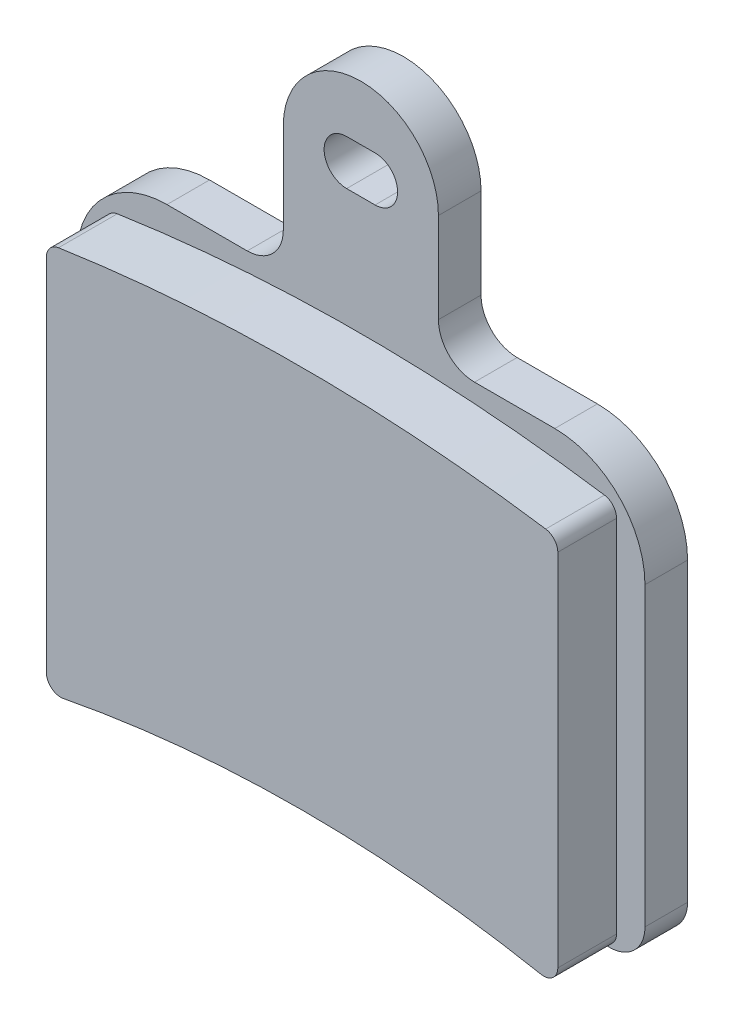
ISO-10303-21;
HEADER;
FILE_DESCRIPTION(('STEP AP214'),'2;1');
FILE_NAME('part.step','',(''),(''),'','','');
FILE_SCHEMA(('AUTOMOTIVE_DESIGN { 1 0 10303 214 1 1 1 1 }'));
ENDSEC;
DATA;
#1=APPLICATION_CONTEXT('core data for automotive mechanical design processes');
#2=APPLICATION_PROTOCOL_DEFINITION('international standard','automotive_design',2000,#1);
#3=PRODUCT_CONTEXT('',#1,'mechanical');
#4=PRODUCT('Part','Part','',(#3));
#5=PRODUCT_RELATED_PRODUCT_CATEGORY('part','',(#4));
#6=PRODUCT_DEFINITION_FORMATION('','',#4);
#7=PRODUCT_DEFINITION_CONTEXT('part definition',#1,'design');
#8=PRODUCT_DEFINITION('design','',#6,#7);
#9=PRODUCT_DEFINITION_SHAPE('','',#8);
#10=(LENGTH_UNIT() NAMED_UNIT(*) SI_UNIT(.MILLI.,.METRE.));
#11=(NAMED_UNIT(*) PLANE_ANGLE_UNIT() SI_UNIT($,.RADIAN.));
#12=(NAMED_UNIT(*) SI_UNIT($,.STERADIAN.) SOLID_ANGLE_UNIT());
#13=UNCERTAINTY_MEASURE_WITH_UNIT(LENGTH_MEASURE(1.E-05),#10,'distance_accuracy_value','');
#14=(GEOMETRIC_REPRESENTATION_CONTEXT(3) GLOBAL_UNCERTAINTY_ASSIGNED_CONTEXT((#13)) GLOBAL_UNIT_ASSIGNED_CONTEXT((#10,
#11,#12)) REPRESENTATION_CONTEXT('',''));
#15=CARTESIAN_POINT('',(0.,0.,0.));
#16=DIRECTION('',(0.,0.,1.));
#17=DIRECTION('',(1.,0.,0.));
#18=AXIS2_PLACEMENT_3D('',#15,#16,#17);
#19=CARTESIAN_POINT('',(-17.0025,-41.3461625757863,3.));
#20=DIRECTION('',(0.,0.,1.));
#21=DIRECTION('',(1.,0.,0.));
#22=AXIS2_PLACEMENT_3D('',#19,#20,#21);
#23=PLANE('',#22);
#24=CARTESIAN_POINT('',(-17.0025,-41.3461625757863,3.));
#25=DIRECTION('',(0.,0.,1.));
#26=DIRECTION('',(1.,0.,0.));
#27=AXIS2_PLACEMENT_3D('',#24,#25,#26);
#28=CIRCLE('',#27,0.999999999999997);
#29=CARTESIAN_POINT('',(-18.0025,-41.3461625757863,3.));
#30=VERTEX_POINT('',#29);
#31=CARTESIAN_POINT('',(-16.8133710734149,-42.3281148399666,3.));
#32=VERTEX_POINT('',#31);
#33=EDGE_CURVE('E124',#30,#32,#28,.T.);
#34=ORIENTED_EDGE('',*,*,#33,.F.);
#35=DIRECTION('',(0.,-1.,0.));
#36=VECTOR('',#35,1.);
#37=CARTESIAN_POINT('',(-18.0025,-41.3461625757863,3.));
#38=LINE('',#37,#36);
#39=CARTESIAN_POINT('',(-18.0025,-16.0012870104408,3.));
#40=VERTEX_POINT('',#39);
#41=EDGE_CURVE('E148',#40,#30,#38,.T.);
#42=ORIENTED_EDGE('',*,*,#41,.F.);
#43=CARTESIAN_POINT('',(-17.0025,-16.0012870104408,3.));
#44=DIRECTION('',(0.,0.,1.));
#45=DIRECTION('',(1.,0.,0.));
#46=AXIS2_PLACEMENT_3D('',#43,#44,#45);
#47=CIRCLE('',#46,0.999999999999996);
#48=CARTESIAN_POINT('',(-17.1504942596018,-15.0122987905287,3.));
#49=VERTEX_POINT('',#48);
#50=EDGE_CURVE('E145',#49,#40,#47,.T.);
#51=ORIENTED_EDGE('',*,*,#50,.F.);
#52=CARTESIAN_POINT('',(0.000190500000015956,-129.623671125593,3.));
#53=DIRECTION('',(0.,0.,1.));
#54=DIRECTION('',(1.,0.,0.));
#55=AXIS2_PLACEMENT_3D('',#52,#53,#54);
#56=CIRCLE('',#55,115.8875);
#57=CARTESIAN_POINT('',(17.1504909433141,-15.0122412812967,3.));
#58=VERTEX_POINT('',#57);
#59=EDGE_CURVE('E142',#58,#49,#56,.T.);
#60=ORIENTED_EDGE('',*,*,#59,.F.);
#61=CARTESIAN_POINT('',(17.0025,-16.0012299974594,3.));
#62=DIRECTION('',(0.,0.,1.));
#63=DIRECTION('',(-1.,0.,0.));
#64=AXIS2_PLACEMENT_3D('',#61,#62,#63);
#65=CIRCLE('',#64,1.);
#66=CARTESIAN_POINT('',(18.0025,-16.0012299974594,3.));
#67=VERTEX_POINT('',#66);
#68=EDGE_CURVE('E139',#67,#58,#65,.T.);
#69=ORIENTED_EDGE('',*,*,#68,.F.);
#70=DIRECTION('',(0.,1.,0.));
#71=VECTOR('',#70,1.);
#72=CARTESIAN_POINT('',(18.0025,-16.0012299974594,3.));
#73=LINE('',#72,#71);
#74=CARTESIAN_POINT('',(18.0025,-41.3460891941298,3.));
#75=VERTEX_POINT('',#74);
#76=EDGE_CURVE('E136',#75,#67,#73,.T.);
#77=ORIENTED_EDGE('',*,*,#76,.F.);
#78=CARTESIAN_POINT('',(17.0025,-41.3460891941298,3.));
#79=DIRECTION('',(0.,0.,1.));
#80=DIRECTION('',(-1.,0.,0.));
#81=AXIS2_PLACEMENT_3D('',#78,#79,#80);
#82=CIRCLE('',#81,1.00000000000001);
#83=CARTESIAN_POINT('',(16.8133753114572,-42.3280422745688,3.));
#84=VERTEX_POINT('',#83);
#85=EDGE_CURVE('E127',#84,#75,#82,.T.);
#86=ORIENTED_EDGE('',*,*,#85,.F.);
#87=CARTESIAN_POINT('',(0.000190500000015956,-129.623671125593,3.));
#88=DIRECTION('',(0.,0.,-1.));
#89=DIRECTION('',(1.,0.,0.));
#90=AXIS2_PLACEMENT_3D('',#87,#88,#89);
#91=CIRCLE('',#90,88.9);
#92=EDGE_CURVE('E116',#32,#84,#91,.T.);
#93=ORIENTED_EDGE('',*,*,#92,.F.);
#94=EDGE_LOOP('',(#34,#42,#51,#60,#69,#77,#86,#93));
#95=FACE_BOUND('',#94,.T.);
#96=ADVANCED_FACE('F45',(#95),#23,.F.);
#97=CARTESIAN_POINT('',(-18.0025,-41.3461625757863,54.6237309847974));
#98=DIRECTION('',(1.,0.,0.));
#99=DIRECTION('',(0.,0.,-1.));
#100=AXIS2_PLACEMENT_3D('',#97,#98,#99);
#101=PLANE('',#100);
#102=DIRECTION('',(0.,0.,-1.));
#103=VECTOR('',#102,1.);
#104=CARTESIAN_POINT('',(-18.0025,-41.3461625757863,54.6237309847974));
#105=LINE('',#104,#103);
#106=CARTESIAN_POINT('',(-18.0025,-41.3461625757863,7.13577999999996));
#107=VERTEX_POINT('',#106);
#108=EDGE_CURVE('E130',#107,#30,#105,.T.);
#109=ORIENTED_EDGE('',*,*,#108,.F.);
#110=DIRECTION('',(0.,1.,0.));
#111=VECTOR('',#110,1.);
#112=CARTESIAN_POINT('',(-18.0025,-41.3461625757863,7.13577999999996));
#113=LINE('',#112,#111);
#114=CARTESIAN_POINT('',(-18.0025,-16.0012870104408,7.13577999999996));
#115=VERTEX_POINT('',#114);
#116=EDGE_CURVE('E49',#107,#115,#113,.T.);
#117=ORIENTED_EDGE('',*,*,#116,.T.);
#118=DIRECTION('',(0.,0.,-1.));
#119=VECTOR('',#118,1.);
#120=CARTESIAN_POINT('',(-18.0025,-16.0012870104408,54.6237309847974));
#121=LINE('',#120,#119);
#122=EDGE_CURVE('E151',#115,#40,#121,.T.);
#123=ORIENTED_EDGE('',*,*,#122,.T.);
#124=ORIENTED_EDGE('',*,*,#41,.T.);
#125=EDGE_LOOP('',(#109,#117,#123,#124));
#126=FACE_BOUND('',#125,.T.);
#127=ADVANCED_FACE('F178',(#126),#101,.F.);
#128=CARTESIAN_POINT('',(-17.0025,-16.0012870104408,54.6237309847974));
#129=DIRECTION('',(0.,0.,-1.));
#130=DIRECTION('',(-1.,0.,0.));
#131=AXIS2_PLACEMENT_3D('',#128,#129,#130);
#132=CYLINDRICAL_SURFACE('',#131,0.999999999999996);
#133=ORIENTED_EDGE('',*,*,#122,.F.);
#134=CARTESIAN_POINT('',(-17.0025,-16.0012870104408,7.13577999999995));
#135=DIRECTION('',(0.,0.,-1.));
#136=DIRECTION('',(-1.,0.,0.));
#137=AXIS2_PLACEMENT_3D('',#134,#135,#136);
#138=CIRCLE('',#137,0.999999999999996);
#139=CARTESIAN_POINT('',(-17.1504942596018,-15.0122987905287,7.13577999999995));
#140=VERTEX_POINT('',#139);
#141=EDGE_CURVE('E172',#115,#140,#138,.T.);
#142=ORIENTED_EDGE('',*,*,#141,.T.);
#143=DIRECTION('',(0.,0.,-1.));
#144=VECTOR('',#143,1.);
#145=CARTESIAN_POINT('',(-17.1504942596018,-15.0122987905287,54.6237309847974));
#146=LINE('',#145,#144);
#147=EDGE_CURVE('E153',#140,#49,#146,.T.);
#148=ORIENTED_EDGE('',*,*,#147,.T.);
#149=ORIENTED_EDGE('',*,*,#50,.T.);
#150=EDGE_LOOP('',(#133,#142,#148,#149));
#151=FACE_BOUND('',#150,.T.);
#152=ADVANCED_FACE('F180',(#151),#132,.T.);
#153=CARTESIAN_POINT('',(0.000190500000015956,-129.623671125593,54.6237309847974));
#154=DIRECTION('',(0.,0.,-1.));
#155=DIRECTION('',(-1.,0.,0.));
#156=AXIS2_PLACEMENT_3D('',#153,#154,#155);
#157=CYLINDRICAL_SURFACE('',#156,115.8875);
#158=ORIENTED_EDGE('',*,*,#147,.F.);
#159=CARTESIAN_POINT('',(0.000190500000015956,-129.623671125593,7.13577999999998));
#160=DIRECTION('',(0.,0.,-1.));
#161=DIRECTION('',(-1.,0.,0.));
#162=AXIS2_PLACEMENT_3D('',#159,#160,#161);
#163=CIRCLE('',#162,115.8875);
#164=CARTESIAN_POINT('',(17.1504909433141,-15.0122412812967,7.13577999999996));
#165=VERTEX_POINT('',#164);
#166=EDGE_CURVE('E64',#140,#165,#163,.T.);
#167=ORIENTED_EDGE('',*,*,#166,.T.);
#168=DIRECTION('',(0.,0.,-1.));
#169=VECTOR('',#168,1.);
#170=CARTESIAN_POINT('',(17.1504909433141,-15.0122412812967,54.6237309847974));
#171=LINE('',#170,#169);
#172=EDGE_CURVE('E155',#165,#58,#171,.T.);
#173=ORIENTED_EDGE('',*,*,#172,.T.);
#174=ORIENTED_EDGE('',*,*,#59,.T.);
#175=EDGE_LOOP('',(#158,#167,#173,#174));
#176=FACE_BOUND('',#175,.T.);
#177=ADVANCED_FACE('F185',(#176),#157,.T.);
#178=CARTESIAN_POINT('',(17.0025,-16.0012299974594,54.6237309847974));
#179=DIRECTION('',(0.,0.,-1.));
#180=DIRECTION('',(-1.,0.,0.));
#181=AXIS2_PLACEMENT_3D('',#178,#179,#180);
#182=CYLINDRICAL_SURFACE('',#181,1.);
#183=ORIENTED_EDGE('',*,*,#172,.F.);
#184=CARTESIAN_POINT('',(17.0025,-16.0012299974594,7.13577999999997));
#185=DIRECTION('',(0.,0.,-1.));
#186=DIRECTION('',(-1.,0.,0.));
#187=AXIS2_PLACEMENT_3D('',#184,#185,#186);
#188=CIRCLE('',#187,1.);
#189=CARTESIAN_POINT('',(18.0025,-16.0012299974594,7.13577999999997));
#190=VERTEX_POINT('',#189);
#191=EDGE_CURVE('E166',#165,#190,#188,.T.);
#192=ORIENTED_EDGE('',*,*,#191,.T.);
#193=DIRECTION('',(0.,0.,-1.));
#194=VECTOR('',#193,1.);
#195=CARTESIAN_POINT('',(18.0025,-16.0012299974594,54.6237309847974));
#196=LINE('',#195,#194);
#197=EDGE_CURVE('E157',#190,#67,#196,.T.);
#198=ORIENTED_EDGE('',*,*,#197,.T.);
#199=ORIENTED_EDGE('',*,*,#68,.T.);
#200=EDGE_LOOP('',(#183,#192,#198,#199));
#201=FACE_BOUND('',#200,.T.);
#202=ADVANCED_FACE('F188',(#201),#182,.T.);
#203=CARTESIAN_POINT('',(18.0025,-16.0012299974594,54.6237309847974));
#204=DIRECTION('',(-1.,0.,0.));
#205=DIRECTION('',(0.,-1.,0.));
#206=AXIS2_PLACEMENT_3D('',#203,#204,#205);
#207=PLANE('',#206);
#208=ORIENTED_EDGE('',*,*,#197,.F.);
#209=DIRECTION('',(0.,-1.,0.));
#210=VECTOR('',#209,1.);
#211=CARTESIAN_POINT('',(18.0025,-16.0012299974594,7.13577999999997));
#212=LINE('',#211,#210);
#213=CARTESIAN_POINT('',(18.0025,-41.3460891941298,7.13577999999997));
#214=VERTEX_POINT('',#213);
#215=EDGE_CURVE('E164',#190,#214,#212,.T.);
#216=ORIENTED_EDGE('',*,*,#215,.T.);
#217=DIRECTION('',(0.,0.,-1.));
#218=VECTOR('',#217,1.);
#219=CARTESIAN_POINT('',(18.0025,-41.3460891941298,54.6237309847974));
#220=LINE('',#219,#218);
#221=EDGE_CURVE('E159',#214,#75,#220,.T.);
#222=ORIENTED_EDGE('',*,*,#221,.T.);
#223=ORIENTED_EDGE('',*,*,#76,.T.);
#224=EDGE_LOOP('',(#208,#216,#222,#223));
#225=FACE_BOUND('',#224,.T.);
#226=ADVANCED_FACE('F191',(#225),#207,.F.);
#227=CARTESIAN_POINT('',(17.0025,-41.3460891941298,54.6237309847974));
#228=DIRECTION('',(0.,0.,-1.));
#229=DIRECTION('',(-1.,0.,0.));
#230=AXIS2_PLACEMENT_3D('',#227,#228,#229);
#231=CYLINDRICAL_SURFACE('',#230,1.00000000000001);
#232=ORIENTED_EDGE('',*,*,#221,.F.);
#233=CARTESIAN_POINT('',(17.0025,-41.3460891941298,7.13577999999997));
#234=DIRECTION('',(0.,0.,-1.));
#235=DIRECTION('',(-1.,0.,0.));
#236=AXIS2_PLACEMENT_3D('',#233,#234,#235);
#237=CIRCLE('',#236,1.00000000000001);
#238=CARTESIAN_POINT('',(16.8133753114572,-42.3280422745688,7.13577999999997));
#239=VERTEX_POINT('',#238);
#240=EDGE_CURVE('E77',#214,#239,#237,.T.);
#241=ORIENTED_EDGE('',*,*,#240,.T.);
#242=DIRECTION('',(0.,0.,-1.));
#243=VECTOR('',#242,1.);
#244=CARTESIAN_POINT('',(16.8133753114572,-42.3280422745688,54.6237309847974));
#245=LINE('',#244,#243);
#246=EDGE_CURVE('E120',#239,#84,#245,.T.);
#247=ORIENTED_EDGE('',*,*,#246,.T.);
#248=ORIENTED_EDGE('',*,*,#85,.T.);
#249=EDGE_LOOP('',(#232,#241,#247,#248));
#250=FACE_BOUND('',#249,.T.);
#251=ADVANCED_FACE('F162',(#250),#231,.T.);
#252=CARTESIAN_POINT('',(0.000190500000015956,-129.623671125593,54.6237309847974));
#253=DIRECTION('',(0.,0.,-1.));
#254=DIRECTION('',(-1.,0.,0.));
#255=AXIS2_PLACEMENT_3D('',#252,#253,#254);
#256=CYLINDRICAL_SURFACE('',#255,88.9);
#257=ORIENTED_EDGE('',*,*,#246,.F.);
#258=CARTESIAN_POINT('',(0.000190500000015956,-129.623671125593,7.13577999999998));
#259=DIRECTION('',(0.,0.,-1.));
#260=DIRECTION('',(-1.,0.,0.));
#261=AXIS2_PLACEMENT_3D('',#258,#259,#260);
#262=CIRCLE('',#261,88.9);
#263=CARTESIAN_POINT('',(-16.8133710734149,-42.3281148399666,7.13577999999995));
#264=VERTEX_POINT('',#263);
#265=EDGE_CURVE('E55',#239,#264,#262,.F.);
#266=ORIENTED_EDGE('',*,*,#265,.T.);
#267=DIRECTION('',(0.,0.,-1.));
#268=VECTOR('',#267,1.);
#269=CARTESIAN_POINT('',(-16.8133710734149,-42.3281148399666,54.6237309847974));
#270=LINE('',#269,#268);
#271=EDGE_CURVE('E113',#264,#32,#270,.T.);
#272=ORIENTED_EDGE('',*,*,#271,.T.);
#273=ORIENTED_EDGE('',*,*,#92,.T.);
#274=EDGE_LOOP('',(#257,#266,#272,#273));
#275=FACE_BOUND('',#274,.T.);
#276=ADVANCED_FACE('F115',(#275),#256,.F.);
#277=CARTESIAN_POINT('',(-17.0025,-41.3461625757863,54.6237309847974));
#278=DIRECTION('',(0.,0.,-1.));
#279=DIRECTION('',(-1.,0.,0.));
#280=AXIS2_PLACEMENT_3D('',#277,#278,#279);
#281=CYLINDRICAL_SURFACE('',#280,0.999999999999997);
#282=ORIENTED_EDGE('',*,*,#271,.F.);
#283=CARTESIAN_POINT('',(-17.0025,-41.3461625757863,7.13577999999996));
#284=DIRECTION('',(0.,0.,-1.));
#285=DIRECTION('',(-1.,0.,0.));
#286=AXIS2_PLACEMENT_3D('',#283,#284,#285);
#287=CIRCLE('',#286,0.999999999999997);
#288=EDGE_CURVE('E13',#264,#107,#287,.T.);
#289=ORIENTED_EDGE('',*,*,#288,.T.);
#290=ORIENTED_EDGE('',*,*,#108,.T.);
#291=ORIENTED_EDGE('',*,*,#33,.T.);
#292=EDGE_LOOP('',(#282,#289,#290,#291));
#293=FACE_BOUND('',#292,.T.);
#294=ADVANCED_FACE('F47',(#293),#281,.T.);
#295=CARTESIAN_POINT('',(-88.2588661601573,109.715518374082,7.13577999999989));
#296=DIRECTION('',(0.,0.,-1.));
#297=DIRECTION('',(0.938239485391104,0.345986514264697,0.));
#298=AXIS2_PLACEMENT_3D('',#295,#296,#297);
#299=PLANE('',#298);
#300=ORIENTED_EDGE('',*,*,#265,.F.);
#301=ORIENTED_EDGE('',*,*,#240,.F.);
#302=ORIENTED_EDGE('',*,*,#215,.F.);
#303=ORIENTED_EDGE('',*,*,#191,.F.);
#304=ORIENTED_EDGE('',*,*,#166,.F.);
#305=ORIENTED_EDGE('',*,*,#141,.F.);
#306=ORIENTED_EDGE('',*,*,#116,.F.);
#307=ORIENTED_EDGE('',*,*,#288,.F.);
#308=EDGE_LOOP('',(#300,#301,#302,#303,#304,#305,#306,#307));
#309=FACE_BOUND('',#308,.T.);
#310=ADVANCED_FACE('F179',(#309),#299,.F.);
#311=CLOSED_SHELL('',(#96,#127,#152,#177,#202,#226,#251,#276,#294,#310));
#312=MANIFOLD_SOLID_BREP('B2',#311);
#313=CARTESIAN_POINT('',(0.,-3.81,3.));
#314=DIRECTION('',(0.,0.,-1.));
#315=DIRECTION('',(-1.,0.,0.));
#316=AXIS2_PLACEMENT_3D('',#313,#314,#315);
#317=CYLINDRICAL_SURFACE('',#316,5.461);
#318=CARTESIAN_POINT('',(0.,-3.81,0.));
#319=DIRECTION('',(0.,0.,1.));
#320=DIRECTION('',(-1.,0.,0.));
#321=AXIS2_PLACEMENT_3D('',#318,#319,#320);
#322=CIRCLE('',#321,5.461);
#323=CARTESIAN_POINT('',(5.461,-3.81,0.));
#324=VERTEX_POINT('',#323);
#325=CARTESIAN_POINT('',(-5.461,-3.81,0.));
#326=VERTEX_POINT('',#325);
#327=EDGE_CURVE('E429',#324,#326,#322,.T.);
#328=ORIENTED_EDGE('',*,*,#327,.T.);
#329=DIRECTION('',(0.,0.,-1.));
#330=VECTOR('',#329,1.);
#331=CARTESIAN_POINT('',(-5.461,-3.81,3.));
#332=LINE('',#331,#330);
#333=CARTESIAN_POINT('',(-5.461,-3.81,3.));
#334=VERTEX_POINT('',#333);
#335=EDGE_CURVE('E43',#334,#326,#332,.T.);
#336=ORIENTED_EDGE('',*,*,#335,.F.);
#337=CARTESIAN_POINT('',(0.,-3.81,3.));
#338=DIRECTION('',(0.,0.,1.));
#339=DIRECTION('',(-1.,0.,0.));
#340=AXIS2_PLACEMENT_3D('',#337,#338,#339);
#341=CIRCLE('',#340,5.461);
#342=CARTESIAN_POINT('',(5.461,-3.81,3.));
#343=VERTEX_POINT('',#342);
#344=EDGE_CURVE('E433',#343,#334,#341,.T.);
#345=ORIENTED_EDGE('',*,*,#344,.F.);
#346=DIRECTION('',(0.,0.,-1.));
#347=VECTOR('',#346,1.);
#348=CARTESIAN_POINT('',(5.461,-3.81,3.));
#349=LINE('',#348,#347);
#350=EDGE_CURVE('E463',#343,#324,#349,.T.);
#351=ORIENTED_EDGE('',*,*,#350,.T.);
#352=EDGE_LOOP('',(#328,#336,#345,#351));
#353=FACE_BOUND('',#352,.T.);
#354=ADVANCED_FACE('F272',(#353),#317,.T.);
#355=CARTESIAN_POINT('',(-5.461,-3.81,3.));
#356=DIRECTION('',(1.,0.,0.));
#357=DIRECTION('',(0.,1.,0.));
#358=AXIS2_PLACEMENT_3D('',#355,#356,#357);
#359=PLANE('',#358);
#360=DIRECTION('',(0.,-1.,0.));
#361=VECTOR('',#360,1.);
#362=CARTESIAN_POINT('',(-5.461,-3.81,0.));
#363=LINE('',#362,#361);
#364=CARTESIAN_POINT('',(-5.461,-10.16,0.));
#365=VERTEX_POINT('',#364);
#366=EDGE_CURVE('E466',#326,#365,#363,.T.);
#367=ORIENTED_EDGE('',*,*,#366,.T.);
#368=DIRECTION('',(0.,0.,-1.));
#369=VECTOR('',#368,1.);
#370=CARTESIAN_POINT('',(-5.461,-10.16,3.));
#371=LINE('',#370,#369);
#372=CARTESIAN_POINT('',(-5.461,-10.16,3.));
#373=VERTEX_POINT('',#372);
#374=EDGE_CURVE('E279',#373,#365,#371,.T.);
#375=ORIENTED_EDGE('',*,*,#374,.F.);
#376=DIRECTION('',(0.,-1.,0.));
#377=VECTOR('',#376,1.);
#378=CARTESIAN_POINT('',(-5.461,-3.81,3.));
#379=LINE('',#378,#377);
#380=EDGE_CURVE('E436',#334,#373,#379,.T.);
#381=ORIENTED_EDGE('',*,*,#380,.F.);
#382=ORIENTED_EDGE('',*,*,#335,.T.);
#383=EDGE_LOOP('',(#367,#375,#381,#382));
#384=FACE_BOUND('',#383,.T.);
#385=ADVANCED_FACE('F551',(#384),#359,.F.);
#386=CARTESIAN_POINT('',(-8.001,-10.16,3.));
#387=DIRECTION('',(0.,0.,-1.));
#388=DIRECTION('',(-1.,0.,0.));
#389=AXIS2_PLACEMENT_3D('',#386,#387,#388);
#390=CYLINDRICAL_SURFACE('',#389,2.54);
#391=CARTESIAN_POINT('',(-8.001,-10.16,0.));
#392=DIRECTION('',(0.,0.,-1.));
#393=DIRECTION('',(1.,0.,0.));
#394=AXIS2_PLACEMENT_3D('',#391,#392,#393);
#395=CIRCLE('',#394,2.54);
#396=CARTESIAN_POINT('',(-8.001,-12.7,0.));
#397=VERTEX_POINT('',#396);
#398=EDGE_CURVE('E468',#365,#397,#395,.T.);
#399=ORIENTED_EDGE('',*,*,#398,.T.);
#400=DIRECTION('',(0.,0.,-1.));
#401=VECTOR('',#400,1.);
#402=CARTESIAN_POINT('',(-8.001,-12.7,3.));
#403=LINE('',#402,#401);
#404=CARTESIAN_POINT('',(-8.001,-12.7,3.));
#405=VERTEX_POINT('',#404);
#406=EDGE_CURVE('E523',#405,#397,#403,.T.);
#407=ORIENTED_EDGE('',*,*,#406,.F.);
#408=CARTESIAN_POINT('',(-8.001,-10.16,3.));
#409=DIRECTION('',(0.,0.,-1.));
#410=DIRECTION('',(1.,0.,0.));
#411=AXIS2_PLACEMENT_3D('',#408,#409,#410);
#412=CIRCLE('',#411,2.54);
#413=EDGE_CURVE('E439',#373,#405,#412,.T.);
#414=ORIENTED_EDGE('',*,*,#413,.F.);
#415=ORIENTED_EDGE('',*,*,#374,.T.);
#416=EDGE_LOOP('',(#399,#407,#414,#415));
#417=FACE_BOUND('',#416,.T.);
#418=ADVANCED_FACE('F530',(#417),#390,.F.);
#419=CARTESIAN_POINT('',(-8.001,-12.7,3.));
#420=DIRECTION('',(0.,-1.,0.));
#421=DIRECTION('',(0.,0.,-1.));
#422=AXIS2_PLACEMENT_3D('',#419,#420,#421);
#423=PLANE('',#422);
#424=DIRECTION('',(-1.,0.,0.));
#425=VECTOR('',#424,1.);
#426=CARTESIAN_POINT('',(-8.001,-12.7,0.));
#427=LINE('',#426,#425);
#428=CARTESIAN_POINT('',(-13.6525,-12.7,0.));
#429=VERTEX_POINT('',#428);
#430=EDGE_CURVE('E470',#397,#429,#427,.T.);
#431=ORIENTED_EDGE('',*,*,#430,.T.);
#432=DIRECTION('',(0.,0.,-1.));
#433=VECTOR('',#432,1.);
#434=CARTESIAN_POINT('',(-13.6525,-12.7,3.));
#435=LINE('',#434,#433);
#436=CARTESIAN_POINT('',(-13.6525,-12.7,3.));
#437=VERTEX_POINT('',#436);
#438=EDGE_CURVE('E520',#437,#429,#435,.T.);
#439=ORIENTED_EDGE('',*,*,#438,.F.);
#440=DIRECTION('',(-1.,0.,0.));
#441=VECTOR('',#440,1.);
#442=CARTESIAN_POINT('',(-8.001,-12.7,3.));
#443=LINE('',#442,#441);
#444=EDGE_CURVE('E441',#405,#437,#443,.T.);
#445=ORIENTED_EDGE('',*,*,#444,.F.);
#446=ORIENTED_EDGE('',*,*,#406,.T.);
#447=EDGE_LOOP('',(#431,#439,#445,#446));
#448=FACE_BOUND('',#447,.T.);
#449=ADVANCED_FACE('F539',(#448),#423,.F.);
#450=CARTESIAN_POINT('',(-13.6525,-19.05,3.));
#451=DIRECTION('',(0.,0.,-1.));
#452=DIRECTION('',(-1.,0.,0.));
#453=AXIS2_PLACEMENT_3D('',#450,#451,#452);
#454=CYLINDRICAL_SURFACE('',#453,6.35);
#455=CARTESIAN_POINT('',(-13.6525,-19.05,0.));
#456=DIRECTION('',(0.,0.,1.));
#457=DIRECTION('',(1.,0.,0.));
#458=AXIS2_PLACEMENT_3D('',#455,#456,#457);
#459=CIRCLE('',#458,6.35);
#460=CARTESIAN_POINT('',(-20.0025,-19.05,0.));
#461=VERTEX_POINT('',#460);
#462=EDGE_CURVE('E472',#429,#461,#459,.T.);
#463=ORIENTED_EDGE('',*,*,#462,.T.);
#464=DIRECTION('',(0.,0.,-1.));
#465=VECTOR('',#464,1.);
#466=CARTESIAN_POINT('',(-20.0025,-19.05,3.));
#467=LINE('',#466,#465);
#468=CARTESIAN_POINT('',(-20.0025,-19.05,3.));
#469=VERTEX_POINT('',#468);
#470=EDGE_CURVE('E517',#469,#461,#467,.T.);
#471=ORIENTED_EDGE('',*,*,#470,.F.);
#472=CARTESIAN_POINT('',(-13.6525,-19.05,3.));
#473=DIRECTION('',(0.,0.,1.));
#474=DIRECTION('',(1.,0.,0.));
#475=AXIS2_PLACEMENT_3D('',#472,#473,#474);
#476=CIRCLE('',#475,6.35);
#477=EDGE_CURVE('E443',#437,#469,#476,.T.);
#478=ORIENTED_EDGE('',*,*,#477,.F.);
#479=ORIENTED_EDGE('',*,*,#438,.T.);
#480=EDGE_LOOP('',(#463,#471,#478,#479));
#481=FACE_BOUND('',#480,.T.);
#482=ADVANCED_FACE('F543',(#481),#454,.T.);
#483=CARTESIAN_POINT('',(-20.0025,-19.05,3.));
#484=DIRECTION('',(1.,0.,0.));
#485=DIRECTION('',(0.,0.,-1.));
#486=AXIS2_PLACEMENT_3D('',#483,#484,#485);
#487=PLANE('',#486);
#488=DIRECTION('',(0.,-1.,0.));
#489=VECTOR('',#488,1.);
#490=CARTESIAN_POINT('',(-20.0025,-19.05,0.));
#491=LINE('',#490,#489);
#492=CARTESIAN_POINT('',(-20.0025,-39.9151663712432,0.));
#493=VERTEX_POINT('',#492);
#494=EDGE_CURVE('E474',#461,#493,#491,.T.);
#495=ORIENTED_EDGE('',*,*,#494,.T.);
#496=DIRECTION('',(0.,0.,-1.));
#497=VECTOR('',#496,1.);
#498=CARTESIAN_POINT('',(-20.0025,-39.9151663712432,3.));
#499=LINE('',#498,#497);
#500=CARTESIAN_POINT('',(-20.0025,-39.9151663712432,3.));
#501=VERTEX_POINT('',#500);
#502=EDGE_CURVE('E514',#501,#493,#499,.T.);
#503=ORIENTED_EDGE('',*,*,#502,.F.);
#504=DIRECTION('',(0.,-1.,0.));
#505=VECTOR('',#504,1.);
#506=CARTESIAN_POINT('',(-20.0025,-19.05,3.));
#507=LINE('',#506,#505);
#508=EDGE_CURVE('E445',#469,#501,#507,.T.);
#509=ORIENTED_EDGE('',*,*,#508,.F.);
#510=ORIENTED_EDGE('',*,*,#470,.T.);
#511=EDGE_LOOP('',(#495,#503,#509,#510));
#512=FACE_BOUND('',#511,.T.);
#513=ADVANCED_FACE('F594',(#512),#487,.F.);
#514=CARTESIAN_POINT('',(-17.5025,-39.9151663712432,3.));
#515=DIRECTION('',(0.,0.,-1.));
#516=DIRECTION('',(-1.,0.,0.));
#517=AXIS2_PLACEMENT_3D('',#514,#515,#516);
#518=CYLINDRICAL_SURFACE('',#517,2.50000000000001);
#519=CARTESIAN_POINT('',(-17.5025,-39.9151663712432,0.));
#520=DIRECTION('',(0.,0.,1.));
#521=DIRECTION('',(1.,0.,0.));
#522=AXIS2_PLACEMENT_3D('',#519,#520,#521);
#523=CIRCLE('',#522,2.50000000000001);
#524=CARTESIAN_POINT('',(-17.0237612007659,-42.3689000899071,0.));
#525=VERTEX_POINT('',#524);
#526=EDGE_CURVE('E476',#493,#525,#523,.T.);
#527=ORIENTED_EDGE('',*,*,#526,.T.);
#528=DIRECTION('',(0.,0.,-1.));
#529=VECTOR('',#528,1.);
#530=CARTESIAN_POINT('',(-17.0237612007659,-42.3689000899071,3.));
#531=LINE('',#530,#529);
#532=CARTESIAN_POINT('',(-17.0237612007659,-42.3689000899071,3.));
#533=VERTEX_POINT('',#532);
#534=EDGE_CURVE('E511',#533,#525,#531,.T.);
#535=ORIENTED_EDGE('',*,*,#534,.F.);
#536=CARTESIAN_POINT('',(-17.5025,-39.9151663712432,3.));
#537=DIRECTION('',(0.,0.,1.));
#538=DIRECTION('',(1.,0.,0.));
#539=AXIS2_PLACEMENT_3D('',#536,#537,#538);
#540=CIRCLE('',#539,2.50000000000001);
#541=EDGE_CURVE('E447',#501,#533,#540,.T.);
#542=ORIENTED_EDGE('',*,*,#541,.F.);
#543=ORIENTED_EDGE('',*,*,#502,.T.);
#544=EDGE_LOOP('',(#527,#535,#542,#543));
#545=FACE_BOUND('',#544,.T.);
#546=ADVANCED_FACE('F592',(#545),#518,.T.);
#547=CARTESIAN_POINT('',(0.000190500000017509,-129.623671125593,3.));
#548=DIRECTION('',(0.,0.,-1.));
#549=DIRECTION('',(-1.,0.,0.));
#550=AXIS2_PLACEMENT_3D('',#547,#548,#549);
#551=CYLINDRICAL_SURFACE('',#550,88.9);
#552=CARTESIAN_POINT('',(0.000190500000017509,-129.623671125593,0.));
#553=DIRECTION('',(0.,0.,-1.));
#554=DIRECTION('',(1.,0.,0.));
#555=AXIS2_PLACEMENT_3D('',#552,#553,#554);
#556=CIRCLE('',#555,88.9);
#557=CARTESIAN_POINT('',(17.0237716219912,-42.3688277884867,0.));
#558=VERTEX_POINT('',#557);
#559=EDGE_CURVE('E478',#525,#558,#556,.T.);
#560=ORIENTED_EDGE('',*,*,#559,.T.);
#561=DIRECTION('',(0.,0.,-1.));
#562=VECTOR('',#561,1.);
#563=CARTESIAN_POINT('',(17.0237716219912,-42.3688277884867,3.));
#564=LINE('',#563,#562);
#565=CARTESIAN_POINT('',(17.0237716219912,-42.3688277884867,3.));
#566=VERTEX_POINT('',#565);
#567=EDGE_CURVE('E508',#566,#558,#564,.T.);
#568=ORIENTED_EDGE('',*,*,#567,.F.);
#569=CARTESIAN_POINT('',(0.000190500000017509,-129.623671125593,3.));
#570=DIRECTION('',(0.,0.,-1.));
#571=DIRECTION('',(1.,0.,0.));
#572=AXIS2_PLACEMENT_3D('',#569,#570,#571);
#573=CIRCLE('',#572,88.9);
#574=EDGE_CURVE('E449',#533,#566,#573,.T.);
#575=ORIENTED_EDGE('',*,*,#574,.F.);
#576=ORIENTED_EDGE('',*,*,#534,.T.);
#577=EDGE_LOOP('',(#560,#568,#575,#576));
#578=FACE_BOUND('',#577,.T.);
#579=ADVANCED_FACE('F587',(#578),#551,.F.);
#580=CARTESIAN_POINT('',(17.5025,-39.9150920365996,3.));
#581=DIRECTION('',(0.,0.,-1.));
#582=DIRECTION('',(-1.,0.,0.));
#583=AXIS2_PLACEMENT_3D('',#580,#581,#582);
#584=CYLINDRICAL_SURFACE('',#583,2.5);
#585=CARTESIAN_POINT('',(17.5025,-39.9150920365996,0.));
#586=DIRECTION('',(0.,0.,1.));
#587=DIRECTION('',(-1.,0.,0.));
#588=AXIS2_PLACEMENT_3D('',#585,#586,#587);
#589=CIRCLE('',#588,2.5);
#590=CARTESIAN_POINT('',(20.0025,-39.9150920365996,0.));
#591=VERTEX_POINT('',#590);
#592=EDGE_CURVE('E480',#558,#591,#589,.T.);
#593=ORIENTED_EDGE('',*,*,#592,.T.);
#594=DIRECTION('',(0.,0.,-1.));
#595=VECTOR('',#594,1.);
#596=CARTESIAN_POINT('',(20.0025,-39.9150920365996,3.));
#597=LINE('',#596,#595);
#598=CARTESIAN_POINT('',(20.0025,-39.9150920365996,3.));
#599=VERTEX_POINT('',#598);
#600=EDGE_CURVE('E505',#599,#591,#597,.T.);
#601=ORIENTED_EDGE('',*,*,#600,.F.);
#602=CARTESIAN_POINT('',(17.5025,-39.9150920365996,3.));
#603=DIRECTION('',(0.,0.,1.));
#604=DIRECTION('',(-1.,0.,0.));
#605=AXIS2_PLACEMENT_3D('',#602,#603,#604);
#606=CIRCLE('',#605,2.5);
#607=EDGE_CURVE('E451',#566,#599,#606,.T.);
#608=ORIENTED_EDGE('',*,*,#607,.F.);
#609=ORIENTED_EDGE('',*,*,#567,.T.);
#610=EDGE_LOOP('',(#593,#601,#608,#609));
#611=FACE_BOUND('',#610,.T.);
#612=ADVANCED_FACE('F582',(#611),#584,.T.);
#613=CARTESIAN_POINT('',(20.0025,-39.9150920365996,3.));
#614=DIRECTION('',(-1.,0.,0.));
#615=DIRECTION('',(0.,-1.,0.));
#616=AXIS2_PLACEMENT_3D('',#613,#614,#615);
#617=PLANE('',#616);
#618=DIRECTION('',(0.,1.,0.));
#619=VECTOR('',#618,1.);
#620=CARTESIAN_POINT('',(20.0025,-39.9150920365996,0.));
#621=LINE('',#620,#619);
#622=CARTESIAN_POINT('',(20.0025,-19.05,0.));
#623=VERTEX_POINT('',#622);
#624=EDGE_CURVE('E482',#591,#623,#621,.T.);
#625=ORIENTED_EDGE('',*,*,#624,.T.);
#626=DIRECTION('',(0.,0.,-1.));
#627=VECTOR('',#626,1.);
#628=CARTESIAN_POINT('',(20.0025,-19.05,3.));
#629=LINE('',#628,#627);
#630=CARTESIAN_POINT('',(20.0025,-19.05,3.));
#631=VERTEX_POINT('',#630);
#632=EDGE_CURVE('E502',#631,#623,#629,.T.);
#633=ORIENTED_EDGE('',*,*,#632,.F.);
#634=DIRECTION('',(0.,1.,0.));
#635=VECTOR('',#634,1.);
#636=CARTESIAN_POINT('',(20.0025,-39.9150920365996,3.));
#637=LINE('',#636,#635);
#638=EDGE_CURVE('E453',#599,#631,#637,.T.);
#639=ORIENTED_EDGE('',*,*,#638,.F.);
#640=ORIENTED_EDGE('',*,*,#600,.T.);
#641=EDGE_LOOP('',(#625,#633,#639,#640));
#642=FACE_BOUND('',#641,.T.);
#643=ADVANCED_FACE('F578',(#642),#617,.F.);
#644=CARTESIAN_POINT('',(13.6525,-19.05,3.));
#645=DIRECTION('',(0.,0.,-1.));
#646=DIRECTION('',(-1.,0.,0.));
#647=AXIS2_PLACEMENT_3D('',#644,#645,#646);
#648=CYLINDRICAL_SURFACE('',#647,6.35);
#649=CARTESIAN_POINT('',(13.6525,-19.05,0.));
#650=DIRECTION('',(0.,0.,1.));
#651=DIRECTION('',(1.,0.,0.));
#652=AXIS2_PLACEMENT_3D('',#649,#650,#651);
#653=CIRCLE('',#652,6.35);
#654=CARTESIAN_POINT('',(13.6525,-12.7,0.));
#655=VERTEX_POINT('',#654);
#656=EDGE_CURVE('E484',#623,#655,#653,.T.);
#657=ORIENTED_EDGE('',*,*,#656,.T.);
#658=DIRECTION('',(0.,0.,-1.));
#659=VECTOR('',#658,1.);
#660=CARTESIAN_POINT('',(13.6525,-12.7,3.));
#661=LINE('',#660,#659);
#662=CARTESIAN_POINT('',(13.6525,-12.7,3.));
#663=VERTEX_POINT('',#662);
#664=EDGE_CURVE('E499',#663,#655,#661,.T.);
#665=ORIENTED_EDGE('',*,*,#664,.F.);
#666=CARTESIAN_POINT('',(13.6525,-19.05,3.));
#667=DIRECTION('',(0.,0.,1.));
#668=DIRECTION('',(1.,0.,0.));
#669=AXIS2_PLACEMENT_3D('',#666,#667,#668);
#670=CIRCLE('',#669,6.35);
#671=EDGE_CURVE('E455',#631,#663,#670,.T.);
#672=ORIENTED_EDGE('',*,*,#671,.F.);
#673=ORIENTED_EDGE('',*,*,#632,.T.);
#674=EDGE_LOOP('',(#657,#665,#672,#673));
#675=FACE_BOUND('',#674,.T.);
#676=ADVANCED_FACE('F573',(#675),#648,.T.);
#677=CARTESIAN_POINT('',(13.6525,-12.7,3.));
#678=DIRECTION('',(0.,-1.,0.));
#679=DIRECTION('',(1.,0.,0.));
#680=AXIS2_PLACEMENT_3D('',#677,#678,#679);
#681=PLANE('',#680);
#682=DIRECTION('',(-1.,0.,0.));
#683=VECTOR('',#682,1.);
#684=CARTESIAN_POINT('',(13.6525,-12.7,0.));
#685=LINE('',#684,#683);
#686=CARTESIAN_POINT('',(8.001,-12.7,0.));
#687=VERTEX_POINT('',#686);
#688=EDGE_CURVE('E486',#655,#687,#685,.T.);
#689=ORIENTED_EDGE('',*,*,#688,.T.);
#690=DIRECTION('',(0.,0.,-1.));
#691=VECTOR('',#690,1.);
#692=CARTESIAN_POINT('',(8.001,-12.7,3.));
#693=LINE('',#692,#691);
#694=CARTESIAN_POINT('',(8.001,-12.7,3.));
#695=VERTEX_POINT('',#694);
#696=EDGE_CURVE('E496',#695,#687,#693,.T.);
#697=ORIENTED_EDGE('',*,*,#696,.F.);
#698=DIRECTION('',(-1.,0.,0.));
#699=VECTOR('',#698,1.);
#700=CARTESIAN_POINT('',(13.6525,-12.7,3.));
#701=LINE('',#700,#699);
#702=EDGE_CURVE('E457',#663,#695,#701,.T.);
#703=ORIENTED_EDGE('',*,*,#702,.F.);
#704=ORIENTED_EDGE('',*,*,#664,.T.);
#705=EDGE_LOOP('',(#689,#697,#703,#704));
#706=FACE_BOUND('',#705,.T.);
#707=ADVANCED_FACE('F567',(#706),#681,.F.);
#708=CARTESIAN_POINT('',(8.001,-10.16,3.));
#709=DIRECTION('',(0.,0.,-1.));
#710=DIRECTION('',(-1.,0.,0.));
#711=AXIS2_PLACEMENT_3D('',#708,#709,#710);
#712=CYLINDRICAL_SURFACE('',#711,2.53999999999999);
#713=CARTESIAN_POINT('',(8.001,-10.16,0.));
#714=DIRECTION('',(0.,0.,-1.));
#715=DIRECTION('',(1.,0.,0.));
#716=AXIS2_PLACEMENT_3D('',#713,#714,#715);
#717=CIRCLE('',#716,2.53999999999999);
#718=CARTESIAN_POINT('',(5.46100000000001,-10.16,0.));
#719=VERTEX_POINT('',#718);
#720=EDGE_CURVE('E488',#687,#719,#717,.T.);
#721=ORIENTED_EDGE('',*,*,#720,.T.);
#722=DIRECTION('',(0.,0.,-1.));
#723=VECTOR('',#722,1.);
#724=CARTESIAN_POINT('',(5.46100000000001,-10.16,3.));
#725=LINE('',#724,#723);
#726=CARTESIAN_POINT('',(5.46100000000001,-10.16,3.));
#727=VERTEX_POINT('',#726);
#728=EDGE_CURVE('E493',#727,#719,#725,.T.);
#729=ORIENTED_EDGE('',*,*,#728,.F.);
#730=CARTESIAN_POINT('',(8.001,-10.16,3.));
#731=DIRECTION('',(0.,0.,-1.));
#732=DIRECTION('',(1.,0.,0.));
#733=AXIS2_PLACEMENT_3D('',#730,#731,#732);
#734=CIRCLE('',#733,2.53999999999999);
#735=EDGE_CURVE('E459',#695,#727,#734,.T.);
#736=ORIENTED_EDGE('',*,*,#735,.F.);
#737=ORIENTED_EDGE('',*,*,#696,.T.);
#738=EDGE_LOOP('',(#721,#729,#736,#737));
#739=FACE_BOUND('',#738,.T.);
#740=ADVANCED_FACE('F563',(#739),#712,.F.);
#741=CARTESIAN_POINT('',(5.46100000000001,-10.16,3.));
#742=DIRECTION('',(-1.,0.,0.));
#743=DIRECTION('',(0.,-1.,0.));
#744=AXIS2_PLACEMENT_3D('',#741,#742,#743);
#745=PLANE('',#744);
#746=DIRECTION('',(0.,1.,0.));
#747=VECTOR('',#746,1.);
#748=CARTESIAN_POINT('',(5.46100000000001,-10.16,0.));
#749=LINE('',#748,#747);
#750=EDGE_CURVE('E437',#719,#324,#749,.T.);
#751=ORIENTED_EDGE('',*,*,#750,.T.);
#752=ORIENTED_EDGE('',*,*,#350,.F.);
#753=DIRECTION('',(0.,1.,0.));
#754=VECTOR('',#753,1.);
#755=CARTESIAN_POINT('',(5.46100000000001,-10.16,3.));
#756=LINE('',#755,#754);
#757=EDGE_CURVE('E461',#727,#343,#756,.T.);
#758=ORIENTED_EDGE('',*,*,#757,.F.);
#759=ORIENTED_EDGE('',*,*,#728,.T.);
#760=EDGE_LOOP('',(#751,#752,#758,#759));
#761=FACE_BOUND('',#760,.T.);
#762=ADVANCED_FACE('F558',(#761),#745,.F.);
#763=CARTESIAN_POINT('',(0.,-3.81,3.));
#764=DIRECTION('',(0.,0.,-1.));
#765=DIRECTION('',(-1.,0.,0.));
#766=AXIS2_PLACEMENT_3D('',#763,#764,#765);
#767=PLANE('',#766);
#768=DIRECTION('',(1.,0.,0.));
#769=VECTOR('',#768,1.);
#770=CARTESIAN_POINT('',(-1.,-5.3975,3.));
#771=LINE('',#770,#769);
#772=CARTESIAN_POINT('',(-1.,-5.3975,3.));
#773=VERTEX_POINT('',#772);
#774=CARTESIAN_POINT('',(1.,-5.3975,3.));
#775=VERTEX_POINT('',#774);
#776=EDGE_CURVE('E423',#773,#775,#771,.T.);
#777=ORIENTED_EDGE('',*,*,#776,.F.);
#778=CARTESIAN_POINT('',(-1.,-3.81,3.));
#779=DIRECTION('',(0.,0.,1.));
#780=DIRECTION('',(1.,0.,0.));
#781=AXIS2_PLACEMENT_3D('',#778,#779,#780);
#782=CIRCLE('',#781,1.5875);
#783=CARTESIAN_POINT('',(-1.,-2.2225,3.));
#784=VERTEX_POINT('',#783);
#785=EDGE_CURVE('E286',#784,#773,#782,.T.);
#786=ORIENTED_EDGE('',*,*,#785,.F.);
#787=DIRECTION('',(-1.,0.,0.));
#788=VECTOR('',#787,1.);
#789=CARTESIAN_POINT('',(-1.,-2.2225,3.));
#790=LINE('',#789,#788);
#791=CARTESIAN_POINT('',(1.,-2.2225,3.));
#792=VERTEX_POINT('',#791);
#793=EDGE_CURVE('E414',#792,#784,#790,.T.);
#794=ORIENTED_EDGE('',*,*,#793,.F.);
#795=CARTESIAN_POINT('',(1.,-3.81,3.));
#796=DIRECTION('',(0.,0.,1.));
#797=DIRECTION('',(1.,0.,0.));
#798=AXIS2_PLACEMENT_3D('',#795,#796,#797);
#799=CIRCLE('',#798,1.5875);
#800=EDGE_CURVE('E417',#775,#792,#799,.T.);
#801=ORIENTED_EDGE('',*,*,#800,.F.);
#802=EDGE_LOOP('',(#777,#786,#794,#801));
#803=FACE_BOUND('',#802,.T.);
#804=ORIENTED_EDGE('',*,*,#344,.T.);
#805=ORIENTED_EDGE('',*,*,#380,.T.);
#806=ORIENTED_EDGE('',*,*,#413,.T.);
#807=ORIENTED_EDGE('',*,*,#444,.T.);
#808=ORIENTED_EDGE('',*,*,#477,.T.);
#809=ORIENTED_EDGE('',*,*,#508,.T.);
#810=ORIENTED_EDGE('',*,*,#541,.T.);
#811=ORIENTED_EDGE('',*,*,#574,.T.);
#812=ORIENTED_EDGE('',*,*,#607,.T.);
#813=ORIENTED_EDGE('',*,*,#638,.T.);
#814=ORIENTED_EDGE('',*,*,#671,.T.);
#815=ORIENTED_EDGE('',*,*,#702,.T.);
#816=ORIENTED_EDGE('',*,*,#735,.T.);
#817=ORIENTED_EDGE('',*,*,#757,.T.);
#818=EDGE_LOOP('',(#804,#805,#806,#807,#808,#809,#810,#811,#812,#813,#814,#815,#816,#817));
#819=FACE_BOUND('',#818,.T.);
#820=ADVANCED_FACE('F547',(#803,#819),#767,.F.);
#821=CARTESIAN_POINT('',(0.,-3.81,0.));
#822=DIRECTION('',(0.,0.,-1.));
#823=DIRECTION('',(-1.,0.,0.));
#824=AXIS2_PLACEMENT_3D('',#821,#822,#823);
#825=PLANE('',#824);
#826=CARTESIAN_POINT('',(-1.,-3.81,0.));
#827=DIRECTION('',(0.,0.,1.));
#828=DIRECTION('',(1.,0.,0.));
#829=AXIS2_PLACEMENT_3D('',#826,#827,#828);
#830=CIRCLE('',#829,1.5875);
#831=CARTESIAN_POINT('',(-1.,-2.2225,0.));
#832=VERTEX_POINT('',#831);
#833=CARTESIAN_POINT('',(-1.,-5.3975,0.));
#834=VERTEX_POINT('',#833);
#835=EDGE_CURVE('E398',#832,#834,#830,.T.);
#836=ORIENTED_EDGE('',*,*,#835,.T.);
#837=DIRECTION('',(1.,0.,0.));
#838=VECTOR('',#837,1.);
#839=CARTESIAN_POINT('',(-1.,-5.3975,0.));
#840=LINE('',#839,#838);
#841=CARTESIAN_POINT('',(1.,-5.3975,0.));
#842=VERTEX_POINT('',#841);
#843=EDGE_CURVE('E407',#834,#842,#840,.T.);
#844=ORIENTED_EDGE('',*,*,#843,.T.);
#845=CARTESIAN_POINT('',(1.,-3.81,0.));
#846=DIRECTION('',(0.,0.,1.));
#847=DIRECTION('',(1.,0.,0.));
#848=AXIS2_PLACEMENT_3D('',#845,#846,#847);
#849=CIRCLE('',#848,1.5875);
#850=CARTESIAN_POINT('',(1.,-2.2225,0.));
#851=VERTEX_POINT('',#850);
#852=EDGE_CURVE('E294',#842,#851,#849,.T.);
#853=ORIENTED_EDGE('',*,*,#852,.T.);
#854=DIRECTION('',(-1.,0.,0.));
#855=VECTOR('',#854,1.);
#856=CARTESIAN_POINT('',(-1.,-2.2225,0.));
#857=LINE('',#856,#855);
#858=EDGE_CURVE('E404',#851,#832,#857,.T.);
#859=ORIENTED_EDGE('',*,*,#858,.T.);
#860=EDGE_LOOP('',(#836,#844,#853,#859));
#861=FACE_BOUND('',#860,.T.);
#862=ORIENTED_EDGE('',*,*,#327,.F.);
#863=ORIENTED_EDGE('',*,*,#750,.F.);
#864=ORIENTED_EDGE('',*,*,#720,.F.);
#865=ORIENTED_EDGE('',*,*,#688,.F.);
#866=ORIENTED_EDGE('',*,*,#656,.F.);
#867=ORIENTED_EDGE('',*,*,#624,.F.);
#868=ORIENTED_EDGE('',*,*,#592,.F.);
#869=ORIENTED_EDGE('',*,*,#559,.F.);
#870=ORIENTED_EDGE('',*,*,#526,.F.);
#871=ORIENTED_EDGE('',*,*,#494,.F.);
#872=ORIENTED_EDGE('',*,*,#462,.F.);
#873=ORIENTED_EDGE('',*,*,#430,.F.);
#874=ORIENTED_EDGE('',*,*,#398,.F.);
#875=ORIENTED_EDGE('',*,*,#366,.F.);
#876=EDGE_LOOP('',(#862,#863,#864,#865,#866,#867,#868,#869,#870,#871,#872,#873,#874,#875));
#877=FACE_BOUND('',#876,.T.);
#878=ADVANCED_FACE('F411',(#861,#877),#825,.T.);
#879=CARTESIAN_POINT('',(-1.,-3.81,0.));
#880=DIRECTION('',(0.,0.,1.));
#881=DIRECTION('',(1.,0.,0.));
#882=AXIS2_PLACEMENT_3D('',#879,#880,#881);
#883=CYLINDRICAL_SURFACE('',#882,1.5875);
#884=ORIENTED_EDGE('',*,*,#785,.T.);
#885=DIRECTION('',(0.,0.,1.));
#886=VECTOR('',#885,1.);
#887=CARTESIAN_POINT('',(-1.,-5.3975,0.));
#888=LINE('',#887,#886);
#889=EDGE_CURVE('E394',#834,#773,#888,.T.);
#890=ORIENTED_EDGE('',*,*,#889,.F.);
#891=ORIENTED_EDGE('',*,*,#835,.F.);
#892=DIRECTION('',(0.,0.,1.));
#893=VECTOR('',#892,1.);
#894=CARTESIAN_POINT('',(-1.,-2.2225,0.));
#895=LINE('',#894,#893);
#896=EDGE_CURVE('E427',#832,#784,#895,.T.);
#897=ORIENTED_EDGE('',*,*,#896,.T.);
#898=EDGE_LOOP('',(#884,#890,#891,#897));
#899=FACE_BOUND('',#898,.T.);
#900=ADVANCED_FACE('F396',(#899),#883,.F.);
#901=CARTESIAN_POINT('',(-1.,-2.2225,0.));
#902=DIRECTION('',(0.,1.,0.));
#903=DIRECTION('',(-1.,0.,0.));
#904=AXIS2_PLACEMENT_3D('',#901,#902,#903);
#905=PLANE('',#904);
#906=ORIENTED_EDGE('',*,*,#793,.T.);
#907=ORIENTED_EDGE('',*,*,#896,.F.);
#908=ORIENTED_EDGE('',*,*,#858,.F.);
#909=DIRECTION('',(0.,0.,1.));
#910=VECTOR('',#909,1.);
#911=CARTESIAN_POINT('',(1.,-2.2225,0.));
#912=LINE('',#911,#910);
#913=EDGE_CURVE('E430',#851,#792,#912,.T.);
#914=ORIENTED_EDGE('',*,*,#913,.T.);
#915=EDGE_LOOP('',(#906,#907,#908,#914));
#916=FACE_BOUND('',#915,.T.);
#917=ADVANCED_FACE('F713',(#916),#905,.F.);
#918=CARTESIAN_POINT('',(1.,-3.81,0.));
#919=DIRECTION('',(0.,0.,1.));
#920=DIRECTION('',(1.,0.,0.));
#921=AXIS2_PLACEMENT_3D('',#918,#919,#920);
#922=CYLINDRICAL_SURFACE('',#921,1.5875);
#923=ORIENTED_EDGE('',*,*,#800,.T.);
#924=ORIENTED_EDGE('',*,*,#913,.F.);
#925=ORIENTED_EDGE('',*,*,#852,.F.);
#926=DIRECTION('',(0.,0.,1.));
#927=VECTOR('',#926,1.);
#928=CARTESIAN_POINT('',(1.,-5.3975,0.));
#929=LINE('',#928,#927);
#930=EDGE_CURVE('E403',#842,#775,#929,.T.);
#931=ORIENTED_EDGE('',*,*,#930,.T.);
#932=EDGE_LOOP('',(#923,#924,#925,#931));
#933=FACE_BOUND('',#932,.T.);
#934=ADVANCED_FACE('F722',(#933),#922,.F.);
#935=CARTESIAN_POINT('',(-1.,-5.3975,0.));
#936=DIRECTION('',(0.,-1.,0.));
#937=DIRECTION('',(0.,0.,-1.));
#938=AXIS2_PLACEMENT_3D('',#935,#936,#937);
#939=PLANE('',#938);
#940=ORIENTED_EDGE('',*,*,#776,.T.);
#941=ORIENTED_EDGE('',*,*,#930,.F.);
#942=ORIENTED_EDGE('',*,*,#843,.F.);
#943=ORIENTED_EDGE('',*,*,#889,.T.);
#944=EDGE_LOOP('',(#940,#941,#942,#943));
#945=FACE_BOUND('',#944,.T.);
#946=ADVANCED_FACE('F408',(#945),#939,.F.);
#947=CLOSED_SHELL('',(#354,#385,#418,#449,#482,#513,#546,#579,#612,#643,#676,#707,#740,#762,
#820,#878,#900,#917,#934,#946));
#948=MANIFOLD_SOLID_BREP('B7',#947);
#949=ADVANCED_BREP_SHAPE_REPRESENTATION('',(#18,#312,#948),#14);
#950=SHAPE_DEFINITION_REPRESENTATION(#9,#949);
ENDSEC;
END-ISO-10303-21;
